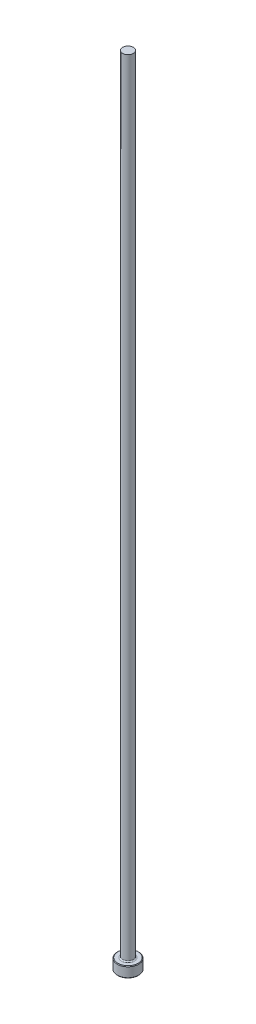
from build123d import *

# Parameters (mm, degrees)
CHAMFER1_SIZE = 0.254
FILLET1_R     = 0.508


with BuildPart() as part:
    # Sketch1 → Revolve1 (revolve)
    with BuildSketch(Plane.XY, mode=Mode.PRIVATE) as revolve1_sk:
        Polygon((0, 0), (-4.7625, 0), (-4.7625, 4.7498), (-2.38125, 4.7498), (-2.38125, 355.6), (0, 355.6), align=None)
    revolve(revolve1_sk.sketch.rotate(Axis((0, 259.958771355, 0), (0, -1, 0)), 270), axis=Axis((0, 259.958771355, 0), (0, -1, 0)))

    # Chamfer1
    chamfer1_edges = [part.edges().sort_by_distance(p)[0] for p in [
        (0, 4.7498, -4.7625),
        (0, 0, -4.7625),
    ]]
    chamfer(chamfer1_edges, length=CHAMFER1_SIZE)

    # Fillet1
    fillet1_edges = [part.edges().sort_by_distance(p)[0] for p in [
        (0, 4.7498, -2.38125),
    ]]
    fillet(fillet1_edges, radius=FILLET1_R)


solid = part.part
